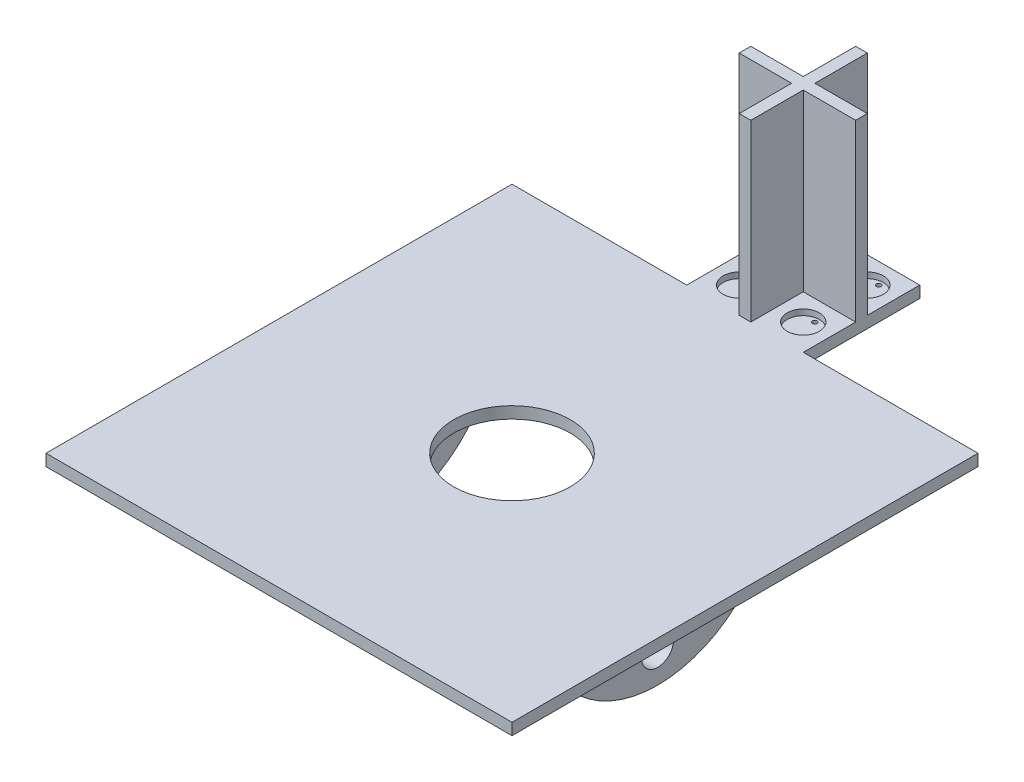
from build123d import *

# Parameters (mm, degrees)
SKETCH1_R               = 12.7
BOSS_EXTRUDE2_DEPTH     = 2.54
BOSS_EXTRUDE4_DEPTH     = 38.1
SKETCH7_W               = 3
SKETCH7_H               = 50.8
BOSS_EXTRUDE5_DEPTH     = 25.4
CUT_EXTRUDE5_DEPTH      = 157.828288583
CUT_EXTRUDE5_DEPTH_BACK = 157.828288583
SKETCH8_R               = 3.5
CUT_EXTRUDE6_REACH      = 158.828
SKETCH9_R               = 0.75
SKETCH10_R              = 3.5
CUT_EXTRUDE7_DEPTH      = 1.27
SKETCH11_R              = 0.5
CUT_EXTRUDE9_DEPTH      = 1.27


with BuildPart() as part:
    # Sketch1 → Boss-Extrude2 (new body)
    with BuildSketch(Plane(origin=(0, 0, 0), x_dir=(1, 0, 0), z_dir=(0, 1, 0))):
        Polygon((0, 101.6), (38.1, 101.6), (38.1, 127), (63.5, 127), (63.5, 101.6), (101.6, 101.6), (101.6, 0), (0, 0), align=None)
        with Locations(Location((50.8, 50.8, 0), (0, 0, 270))):
            Circle(SKETCH1_R, mode=Mode.SUBTRACT)
    extrude(amount=BOSS_EXTRUDE2_DEPTH)

    # Sketch2 → Boss-Extrude4 (add)
    with BuildSketch(Plane(origin=(0, 2.54, 0), x_dir=(1, 0, 0), z_dir=(0, 1, 0))):
        Polygon((52.07, 101.6), (49.53, 101.6), (49.53, 113.03), (38.1, 113.03), (38.1, 115.57), (49.53, 115.57), (49.53, 127), (52.07, 127), (52.07, 115.57), (63.5, 115.57), (63.5, 113.03), (52.07, 113.03), align=None)
    extrude(amount=BOSS_EXTRUDE4_DEPTH)

    # Sketch7 → Boss-Extrude5 (add)
    with BuildSketch(Plane.XZ):
        with Locations((20.55, -50.8)):
            Rectangle(SKETCH7_W, SKETCH7_H)
        with Locations((81.05, -50.8)):
            Rectangle(SKETCH7_W, SKETCH7_H)
    extrude(amount=BOSS_EXTRUDE5_DEPTH)

    # Sketch8 → Cut-Extrude5 (cut, two sides: drawn at the far end of the back side and taken through both)
    with BuildSketch(Plane.ZY.offset(-19.05).offset(-CUT_EXTRUDE5_DEPTH_BACK)):
        with BuildLine():
            ThreePointArc((-50.8, -25.4), (-68.760512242, -17.960512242), (-76.2, 0))
            Line((-76.2, 0), (-76.2, -25.4))
            Line((-76.2, -25.4), (-50.8, -25.4))
        make_face()
        with BuildLine():
            ThreePointArc((-25.4, 0), (-32.839487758, -17.960512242), (-50.8, -25.4))
            Line((-50.8, -25.4), (-25.4, -25.4))
            Line((-25.4, -25.4), (-25.4, 0))
        make_face()
        with Locations((-50.8, -18.523310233)):
            Circle(SKETCH8_R)
    extrude(amount=CUT_EXTRUDE5_DEPTH + CUT_EXTRUDE5_DEPTH_BACK, mode=Mode.SUBTRACT)

    # Sketch9 → Cut-Extrude6 (cut, up to next)
    with BuildSketch(Plane(origin=(82.55, 0, 0), x_dir=(0, 0, -1), z_dir=(1, 0, 0)), mode=Mode.PRIVATE) as cut_extrude6_sk1:
        with Locations((50.8, -7.523310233)):
            Circle(SKETCH9_R)
    cut_extrude6_tool1 = extrude(cut_extrude6_sk1.sketch, amount=-CUT_EXTRUDE6_REACH, mode=Mode.PRIVATE) & part.part
    add(cut_extrude6_tool1.solids().sort_by_distance((82.55, -7.52331, -50.8))[0], mode=Mode.SUBTRACT)

    # Sketch10 → Cut-Extrude7 (cut)
    with BuildSketch(Plane(origin=(0, 2.54, 0), x_dir=(1, 0, 0), z_dir=(0, 1, 0))):
        with Locations(Location((43.815, 121.285, 0), (0, 0, 270))):
            Circle(SKETCH10_R)
        with Locations(Location((43.815, 107.315, 0), (0, 0, 270))):
            Circle(SKETCH10_R)
        with Locations(Location((57.785, 107.315, 0), (0, 0, 270))):
            Circle(SKETCH10_R)
        with Locations(Location((57.785, 121.285, 0), (0, 0, 270))):
            Circle(SKETCH10_R)
    extrude(amount=-CUT_EXTRUDE7_DEPTH, mode=Mode.SUBTRACT)

    # Sketch11 → Cut-Extrude9 (cut)
    with BuildSketch(Plane(origin=(0, 1.27, 0), x_dir=(1, 0, 0), z_dir=(0, 1, 0))):
        with Locations(Location((43.815, 118.785, 0), (0, 0, 270))):
            Circle(SKETCH11_R)
        with Locations(Location((43.815, 104.815, 0), (0, 0, 270))):
            Circle(SKETCH11_R)
        with Locations(Location((43.815, 109.815, 0), (0, 0, 270))):
            Circle(SKETCH11_R)
        with Locations(Location((57.785, 109.815, 0), (0, 0, 270))):
            Circle(SKETCH11_R)
        with Locations(Location((57.785, 118.785, 0), (0, 0, 270))):
            Circle(SKETCH11_R)
        with Locations(Location((57.785, 123.785, 0), (0, 0, 270))):
            Circle(SKETCH11_R)
        with Locations(Location((43.815, 123.785, 0), (0, 0, 270))):
            Circle(SKETCH11_R)
        with Locations(Location((57.785, 104.815, 0), (0, 0, 270))):
            Circle(SKETCH11_R)
    extrude(amount=-CUT_EXTRUDE9_DEPTH, mode=Mode.SUBTRACT)


solid = part.part
